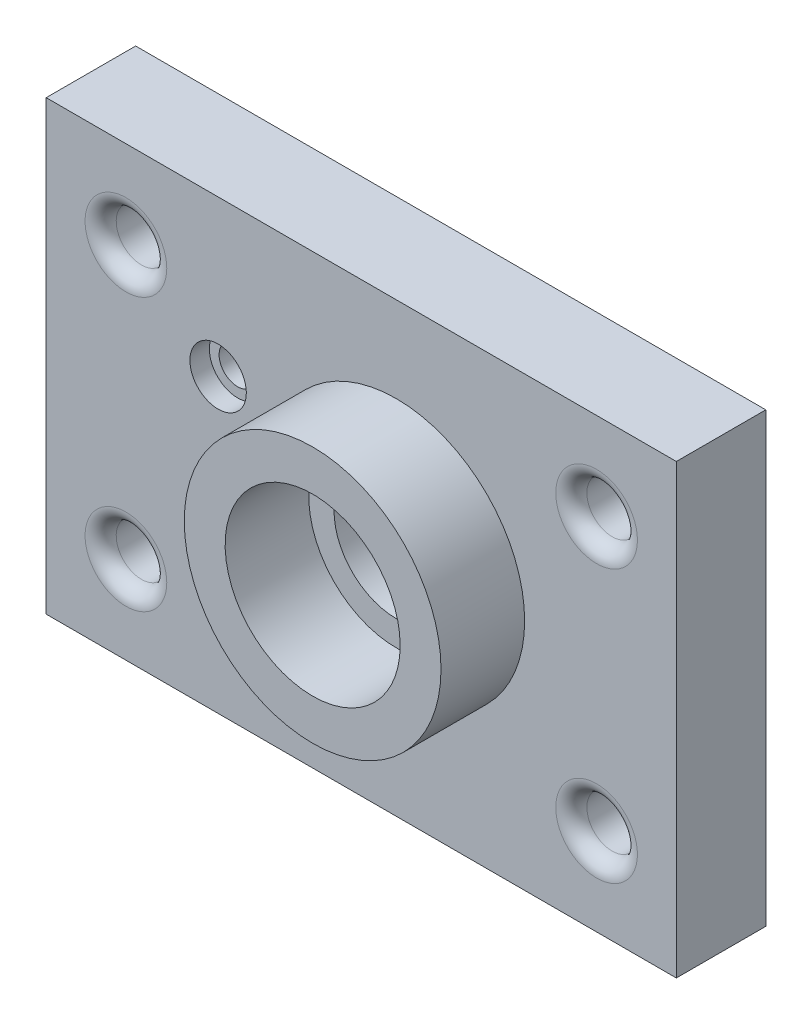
from build123d import *

# Parameters (mm, degrees)
SKETCH1_W           = 162
SKETCH1_H           = 115
BOSS_EXTRUDE1_DEPTH = 23
SKETCH2_R           = 33
SKETCH2_R_2         = 22.5
BOSS_EXTRUDE2_DEPTH = 21.5
SKETCH4_R           = 4.75
SKETCH4_R_2         = 6.5
CUT_EXTRUDE1_DEPTH  = 200.994999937
FILLET2_R           = 4
FILLET3_R           = 4
SKETCH5_R           = 7.25
CUT_EXTRUDE2_DEPTH  = 5
SKETCH6_R           = 16
CUT_EXTRUDE3_DEPTH  = 200.994999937


with BuildPart() as part:
    # Sketch1 → Boss-Extrude1 (new body)
    with BuildSketch(Plane(origin=(0, 0, 0), x_dir=(1, 0, 0), z_dir=(0, 0, -1))):
        with Locations((81, 57.5)):
            Rectangle(SKETCH1_W, SKETCH1_H)
    extrude(amount=-BOSS_EXTRUDE1_DEPTH)

    # Sketch2 → Boss-Extrude2 (add)
    with BuildSketch(Plane(origin=(0, 0, 23), x_dir=(-1, 0, 0), z_dir=(0, 0, 1))):
        with Locations(Location((-90, 55, 0), (0, 0, 90))):
            Circle(SKETCH2_R)
        with Locations(Location((-90, 55, 0), (0, 0, 180))):
            Circle(SKETCH2_R_2, mode=Mode.SUBTRACT)
    extrude(amount=BOSS_EXTRUDE2_DEPTH)

    # Sketch4 → Cut-Extrude1 (cut, through all)
    with BuildSketch(Plane(origin=(0, 0, 23), x_dir=(-1, 0, 0), z_dir=(0, 0, 1))):
        with Locations(Location((-44.2, 40, 0), (0, 0, 90))):
            Circle(SKETCH4_R)
        with Locations(Location((-20.5, 92.5, 0), (0, 0, 90))):
            Circle(SKETCH4_R_2)
        with Locations(Location((-20.5, 22.5, 0), (0, 0, 90))):
            Circle(SKETCH4_R_2)
        with Locations(Location((-141.5, 22.5, 0), (0, 0, 90))):
            Circle(SKETCH4_R_2)
        with Locations(Location((-141.5, 92.5, 0), (0, 0, 90))):
            Circle(SKETCH4_R_2)
    extrude(amount=-CUT_EXTRUDE1_DEPTH, mode=Mode.SUBTRACT)

    # Fillet2
    fillet2_edges = [part.edges().sort_by_distance(p)[0] for p in [
        (20.5, -86, 23),
    ]]
    fillet(fillet2_edges, radius=FILLET2_R)

    # Fillet3
    fillet3_edges = [part.edges().sort_by_distance(p)[0] for p in [
        (20.5, -16, 23),
        (141.5, -16, 23),
        (141.5, -86, 23),
    ]]
    fillet(fillet3_edges, radius=FILLET3_R)

    # Sketch5 → Cut-Extrude2 (cut)
    with BuildSketch(Plane(origin=(0, 0, 23), x_dir=(-1, 0, 0), z_dir=(0, 0, 1))):
        with Locations(Location((-44.2, 40, 0), (0, 0, 90))):
            Circle(SKETCH5_R)
    extrude(amount=-CUT_EXTRUDE2_DEPTH, mode=Mode.SUBTRACT)

    # Sketch6 → Cut-Extrude3 (cut, through all)
    with BuildSketch(Plane(origin=(0, 0, 23), x_dir=(-1, 0, 0), z_dir=(0, 0, 1))):
        with Locations(Location((-90, 55, 0), (0, 0, 90))):
            Circle(SKETCH6_R)
    extrude(amount=-CUT_EXTRUDE3_DEPTH, mode=Mode.SUBTRACT)


solid = part.part
